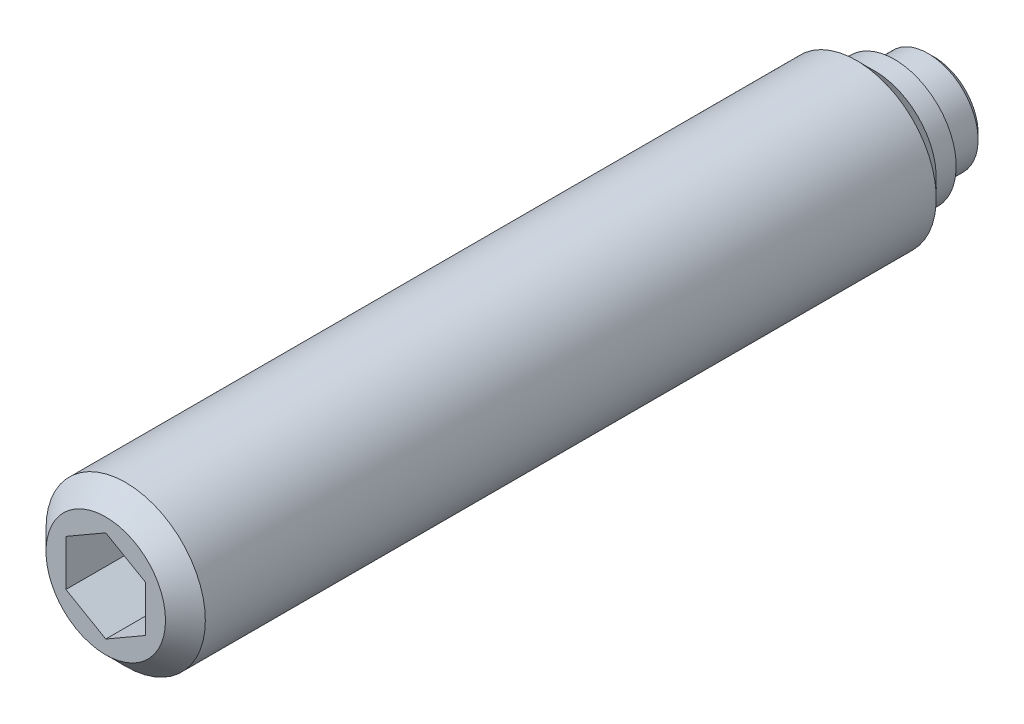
ISO-10303-21;
HEADER;
FILE_DESCRIPTION(('STEP AP214'),'2;1');
FILE_NAME('part.step','',(''),(''),'','','');
FILE_SCHEMA(('AUTOMOTIVE_DESIGN { 1 0 10303 214 1 1 1 1 }'));
ENDSEC;
DATA;
#1=APPLICATION_CONTEXT('core data for automotive mechanical design processes');
#2=APPLICATION_PROTOCOL_DEFINITION('international standard','automotive_design',2000,#1);
#3=PRODUCT_CONTEXT('',#1,'mechanical');
#4=PRODUCT('Part','Part','',(#3));
#5=PRODUCT_RELATED_PRODUCT_CATEGORY('part','',(#4));
#6=PRODUCT_DEFINITION_FORMATION('','',#4);
#7=PRODUCT_DEFINITION_CONTEXT('part definition',#1,'design');
#8=PRODUCT_DEFINITION('design','',#6,#7);
#9=PRODUCT_DEFINITION_SHAPE('','',#8);
#10=(LENGTH_UNIT() NAMED_UNIT(*) SI_UNIT(.MILLI.,.METRE.));
#11=(NAMED_UNIT(*) PLANE_ANGLE_UNIT() SI_UNIT($,.RADIAN.));
#12=(NAMED_UNIT(*) SI_UNIT($,.STERADIAN.) SOLID_ANGLE_UNIT());
#13=UNCERTAINTY_MEASURE_WITH_UNIT(LENGTH_MEASURE(1.E-05),#10,'distance_accuracy_value','');
#14=(GEOMETRIC_REPRESENTATION_CONTEXT(3) GLOBAL_UNCERTAINTY_ASSIGNED_CONTEXT((#13)) GLOBAL_UNIT_ASSIGNED_CONTEXT((#10,
#11,#12)) REPRESENTATION_CONTEXT('',''));
#15=CARTESIAN_POINT('',(0.,0.,0.));
#16=DIRECTION('',(0.,0.,1.));
#17=DIRECTION('',(1.,0.,0.));
#18=AXIS2_PLACEMENT_3D('',#15,#16,#17);
#19=CARTESIAN_POINT('',(0.,0.,2.));
#20=DIRECTION('',(0.,0.,-1.));
#21=DIRECTION('',(-1.,0.,0.));
#22=AXIS2_PLACEMENT_3D('',#19,#20,#21);
#23=CYLINDRICAL_SURFACE('',#22,4.);
#24=CARTESIAN_POINT('',(0.,0.,40.6));
#25=DIRECTION('',(0.,0.,1.));
#26=DIRECTION('',(1.,0.,0.));
#27=AXIS2_PLACEMENT_3D('',#24,#25,#26);
#28=CIRCLE('',#27,4.);
#29=CARTESIAN_POINT('',(4.,0.,40.6));
#30=VERTEX_POINT('',#29);
#31=EDGE_CURVE('E9',#30,#30,#28,.F.);
#32=ORIENTED_EDGE('',*,*,#31,.T.);
#33=EDGE_LOOP('',(#32));
#34=FACE_BOUND('',#33,.T.);
#35=CARTESIAN_POINT('',(0.,0.,3.9));
#36=DIRECTION('',(0.,0.,-1.));
#37=DIRECTION('',(-1.,0.,0.));
#38=AXIS2_PLACEMENT_3D('',#35,#36,#37);
#39=CIRCLE('',#38,4.);
#40=CARTESIAN_POINT('',(-4.,0.,3.9));
#41=VERTEX_POINT('',#40);
#42=EDGE_CURVE('E74',#41,#41,#39,.T.);
#43=ORIENTED_EDGE('',*,*,#42,.F.);
#44=EDGE_LOOP('',(#43));
#45=FACE_BOUND('',#44,.T.);
#46=ADVANCED_FACE('F14',(#34,#45),#23,.T.);
#47=CARTESIAN_POINT('',(0.,0.,0.));
#48=DIRECTION('',(0.,0.,-1.));
#49=DIRECTION('',(-1.,0.,0.));
#50=AXIS2_PLACEMENT_3D('',#47,#48,#49);
#51=CYLINDRICAL_SURFACE('',#50,2.5);
#52=CARTESIAN_POINT('',(0.,0.,0.3));
#53=DIRECTION('',(0.,0.,-1.));
#54=DIRECTION('',(-1.,0.,0.));
#55=AXIS2_PLACEMENT_3D('',#52,#53,#54);
#56=CIRCLE('',#55,2.5);
#57=CARTESIAN_POINT('',(-2.5,0.,0.3));
#58=VERTEX_POINT('',#57);
#59=EDGE_CURVE('E106',#58,#58,#56,.T.);
#60=ORIENTED_EDGE('',*,*,#59,.F.);
#61=EDGE_LOOP('',(#60));
#62=FACE_BOUND('',#61,.T.);
#63=CARTESIAN_POINT('',(0.,0.,2.));
#64=DIRECTION('',(0.,0.,-1.));
#65=DIRECTION('',(-1.,0.,0.));
#66=AXIS2_PLACEMENT_3D('',#63,#64,#65);
#67=CIRCLE('',#66,2.5);
#68=CARTESIAN_POINT('',(-2.5,0.,2.));
#69=VERTEX_POINT('',#68);
#70=EDGE_CURVE('E100',#69,#69,#67,.T.);
#71=ORIENTED_EDGE('',*,*,#70,.T.);
#72=EDGE_LOOP('',(#71));
#73=FACE_BOUND('',#72,.T.);
#74=ADVANCED_FACE('F130',(#62,#73),#51,.T.);
#75=CARTESIAN_POINT('',(0.,0.,0.3));
#76=DIRECTION('',(0.,0.,1.));
#77=DIRECTION('',(1.,0.,0.));
#78=AXIS2_PLACEMENT_3D('',#75,#76,#77);
#79=CONICAL_SURFACE('',#78,2.5,0.785398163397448);
#80=CARTESIAN_POINT('',(0.,0.,0.));
#81=DIRECTION('',(0.,0.,-1.));
#82=DIRECTION('',(-1.,0.,0.));
#83=AXIS2_PLACEMENT_3D('',#80,#81,#82);
#84=CIRCLE('',#83,2.2);
#85=CARTESIAN_POINT('',(-2.2,0.,0.));
#86=VERTEX_POINT('',#85);
#87=EDGE_CURVE('E103',#86,#86,#84,.T.);
#88=ORIENTED_EDGE('',*,*,#87,.F.);
#89=EDGE_LOOP('',(#88));
#90=FACE_BOUND('',#89,.T.);
#91=ORIENTED_EDGE('',*,*,#59,.T.);
#92=EDGE_LOOP('',(#91));
#93=FACE_BOUND('',#92,.T.);
#94=ADVANCED_FACE('F135',(#90,#93),#79,.T.);
#95=CARTESIAN_POINT('',(0.,2.2,0.));
#96=DIRECTION('',(0.,0.,1.));
#97=DIRECTION('',(1.,0.,0.));
#98=AXIS2_PLACEMENT_3D('',#95,#96,#97);
#99=PLANE('',#98);
#100=ORIENTED_EDGE('',*,*,#87,.T.);
#101=EDGE_LOOP('',(#100));
#102=FACE_BOUND('',#101,.T.);
#103=ADVANCED_FACE('F150',(#102),#99,.F.);
#104=CARTESIAN_POINT('',(0.,3.1,2.));
#105=DIRECTION('',(0.,0.,1.));
#106=DIRECTION('',(1.,0.,0.));
#107=AXIS2_PLACEMENT_3D('',#104,#105,#106);
#108=PLANE('',#107);
#109=CARTESIAN_POINT('',(0.,0.,2.));
#110=DIRECTION('',(0.,0.,-1.));
#111=DIRECTION('',(-1.,0.,0.));
#112=AXIS2_PLACEMENT_3D('',#109,#110,#111);
#113=CIRCLE('',#112,3.1);
#114=CARTESIAN_POINT('',(-3.1,0.,2.));
#115=VERTEX_POINT('',#114);
#116=EDGE_CURVE('E109',#115,#115,#113,.T.);
#117=ORIENTED_EDGE('',*,*,#116,.T.);
#118=EDGE_LOOP('',(#117));
#119=FACE_BOUND('',#118,.T.);
#120=ORIENTED_EDGE('',*,*,#70,.F.);
#121=EDGE_LOOP('',(#120));
#122=FACE_BOUND('',#121,.T.);
#123=ADVANCED_FACE('F147',(#119,#122),#108,.F.);
#124=CARTESIAN_POINT('',(0.,0.,2.));
#125=DIRECTION('',(0.,0.,-1.));
#126=DIRECTION('',(-1.,0.,0.));
#127=AXIS2_PLACEMENT_3D('',#124,#125,#126);
#128=CYLINDRICAL_SURFACE('',#127,3.1);
#129=CARTESIAN_POINT('',(0.,0.,3.));
#130=DIRECTION('',(0.,0.,-1.));
#131=DIRECTION('',(-1.,0.,0.));
#132=AXIS2_PLACEMENT_3D('',#129,#130,#131);
#133=CIRCLE('',#132,3.1);
#134=CARTESIAN_POINT('',(-3.1,0.,3.));
#135=VERTEX_POINT('',#134);
#136=EDGE_CURVE('E112',#135,#135,#133,.T.);
#137=ORIENTED_EDGE('',*,*,#136,.T.);
#138=EDGE_LOOP('',(#137));
#139=FACE_BOUND('',#138,.T.);
#140=ORIENTED_EDGE('',*,*,#116,.F.);
#141=EDGE_LOOP('',(#140));
#142=FACE_BOUND('',#141,.T.);
#143=ADVANCED_FACE('F143',(#139,#142),#128,.T.);
#144=CARTESIAN_POINT('',(0.,0.,3.9));
#145=DIRECTION('',(0.,0.,1.));
#146=DIRECTION('',(1.,0.,0.));
#147=AXIS2_PLACEMENT_3D('',#144,#145,#146);
#148=CONICAL_SURFACE('',#147,4.,0.78539816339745);
#149=ORIENTED_EDGE('',*,*,#42,.T.);
#150=EDGE_LOOP('',(#149));
#151=FACE_BOUND('',#150,.T.);
#152=ORIENTED_EDGE('',*,*,#136,.F.);
#153=EDGE_LOOP('',(#152));
#154=FACE_BOUND('',#153,.T.);
#155=ADVANCED_FACE('F140',(#151,#154),#148,.T.);
#156=CARTESIAN_POINT('',(0.,0.,41.6));
#157=DIRECTION('',(0.,0.,1.));
#158=DIRECTION('',(1.,0.,0.));
#159=AXIS2_PLACEMENT_3D('',#156,#157,#158);
#160=PLANE('',#159);
#161=CARTESIAN_POINT('',(0.,0.,41.6));
#162=DIRECTION('',(0.,0.,1.));
#163=DIRECTION('',(1.,0.,0.));
#164=AXIS2_PLACEMENT_3D('',#161,#162,#163);
#165=CIRCLE('',#164,3.);
#166=CARTESIAN_POINT('',(3.,0.,41.6));
#167=VERTEX_POINT('',#166);
#168=EDGE_CURVE('E22',#167,#167,#165,.T.);
#169=ORIENTED_EDGE('',*,*,#168,.T.);
#170=EDGE_LOOP('',(#169));
#171=FACE_BOUND('',#170,.T.);
#172=DIRECTION('',(-0.866025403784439,0.5,0.));
#173=VECTOR('',#172,1.);
#174=CARTESIAN_POINT('',(-2.,-1.15470053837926,41.6));
#175=LINE('',#174,#173);
#176=CARTESIAN_POINT('',(0.,-2.30940107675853,41.6));
#177=VERTEX_POINT('',#176);
#178=CARTESIAN_POINT('',(-2.,-1.15470053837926,41.6));
#179=VERTEX_POINT('',#178);
#180=EDGE_CURVE('E69',#177,#179,#175,.T.);
#181=ORIENTED_EDGE('',*,*,#180,.T.);
#182=DIRECTION('',(0.,1.,0.));
#183=VECTOR('',#182,1.);
#184=CARTESIAN_POINT('',(-2.,1.15470053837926,41.6));
#185=LINE('',#184,#183);
#186=CARTESIAN_POINT('',(-2.,1.15470053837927,41.6));
#187=VERTEX_POINT('',#186);
#188=EDGE_CURVE('E84',#179,#187,#185,.T.);
#189=ORIENTED_EDGE('',*,*,#188,.T.);
#190=DIRECTION('',(0.866025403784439,0.5,0.));
#191=VECTOR('',#190,1.);
#192=CARTESIAN_POINT('',(0.,2.30940107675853,41.6));
#193=LINE('',#192,#191);
#194=CARTESIAN_POINT('',(0.,2.30940107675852,41.6));
#195=VERTEX_POINT('',#194);
#196=EDGE_CURVE('E301',#187,#195,#193,.T.);
#197=ORIENTED_EDGE('',*,*,#196,.T.);
#198=DIRECTION('',(0.866025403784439,-0.5,0.));
#199=VECTOR('',#198,1.);
#200=CARTESIAN_POINT('',(2.,1.15470053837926,41.6));
#201=LINE('',#200,#199);
#202=CARTESIAN_POINT('',(2.,1.15470053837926,41.6));
#203=VERTEX_POINT('',#202);
#204=EDGE_CURVE('E298',#195,#203,#201,.T.);
#205=ORIENTED_EDGE('',*,*,#204,.T.);
#206=DIRECTION('',(0.,-1.,0.));
#207=VECTOR('',#206,1.);
#208=CARTESIAN_POINT('',(2.,-1.15470053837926,41.6));
#209=LINE('',#208,#207);
#210=CARTESIAN_POINT('',(2.,-1.15470053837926,41.6));
#211=VERTEX_POINT('',#210);
#212=EDGE_CURVE('E29',#203,#211,#209,.T.);
#213=ORIENTED_EDGE('',*,*,#212,.T.);
#214=DIRECTION('',(-0.866025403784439,-0.5,0.));
#215=VECTOR('',#214,1.);
#216=CARTESIAN_POINT('',(0.,-2.30940107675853,41.6));
#217=LINE('',#216,#215);
#218=EDGE_CURVE('E66',#211,#177,#217,.T.);
#219=ORIENTED_EDGE('',*,*,#218,.T.);
#220=EDGE_LOOP('',(#181,#189,#197,#205,#213,#219));
#221=FACE_BOUND('',#220,.T.);
#222=ADVANCED_FACE('F68',(#171,#221),#160,.T.);
#223=CARTESIAN_POINT('',(0.,0.,36.6));
#224=DIRECTION('',(0.,0.,1.));
#225=DIRECTION('',(1.,0.,0.));
#226=AXIS2_PLACEMENT_3D('',#223,#224,#225);
#227=PLANE('',#226);
#228=DIRECTION('',(0.,-1.,0.));
#229=VECTOR('',#228,1.);
#230=CARTESIAN_POINT('',(-2.,1.15470053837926,36.6));
#231=LINE('',#230,#229);
#232=CARTESIAN_POINT('',(-2.,1.15470053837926,36.6));
#233=VERTEX_POINT('',#232);
#234=CARTESIAN_POINT('',(-2.,-1.15470053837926,36.6));
#235=VERTEX_POINT('',#234);
#236=EDGE_CURVE('E83',#233,#235,#231,.T.);
#237=ORIENTED_EDGE('',*,*,#236,.T.);
#238=DIRECTION('',(0.866025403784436,-0.5,0.));
#239=VECTOR('',#238,1.);
#240=CARTESIAN_POINT('',(-2.,-1.15470053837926,36.6));
#241=LINE('',#240,#239);
#242=CARTESIAN_POINT('',(0.,-2.30940107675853,36.6));
#243=VERTEX_POINT('',#242);
#244=EDGE_CURVE('E280',#235,#243,#241,.T.);
#245=ORIENTED_EDGE('',*,*,#244,.T.);
#246=DIRECTION('',(0.866025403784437,0.5,0.));
#247=VECTOR('',#246,1.);
#248=CARTESIAN_POINT('',(0.,-2.30940107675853,36.6));
#249=LINE('',#248,#247);
#250=CARTESIAN_POINT('',(2.,-1.15470053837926,36.6));
#251=VERTEX_POINT('',#250);
#252=EDGE_CURVE('E88',#243,#251,#249,.T.);
#253=ORIENTED_EDGE('',*,*,#252,.T.);
#254=DIRECTION('',(0.,1.,0.));
#255=VECTOR('',#254,1.);
#256=CARTESIAN_POINT('',(2.,-1.15470053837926,36.6));
#257=LINE('',#256,#255);
#258=CARTESIAN_POINT('',(2.,1.15470053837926,36.6));
#259=VERTEX_POINT('',#258);
#260=EDGE_CURVE('E287',#251,#259,#257,.T.);
#261=ORIENTED_EDGE('',*,*,#260,.T.);
#262=DIRECTION('',(-0.866025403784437,0.5,0.));
#263=VECTOR('',#262,1.);
#264=CARTESIAN_POINT('',(2.,1.15470053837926,36.6));
#265=LINE('',#264,#263);
#266=CARTESIAN_POINT('',(0.,2.30940107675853,36.6));
#267=VERTEX_POINT('',#266);
#268=EDGE_CURVE('E96',#259,#267,#265,.T.);
#269=ORIENTED_EDGE('',*,*,#268,.T.);
#270=DIRECTION('',(-0.866025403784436,-0.5,0.));
#271=VECTOR('',#270,1.);
#272=CARTESIAN_POINT('',(0.,2.30940107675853,36.6));
#273=LINE('',#272,#271);
#274=EDGE_CURVE('E91',#267,#233,#273,.T.);
#275=ORIENTED_EDGE('',*,*,#274,.T.);
#276=EDGE_LOOP('',(#237,#245,#253,#261,#269,#275));
#277=FACE_BOUND('',#276,.T.);
#278=ADVANCED_FACE('F162',(#277),#227,.T.);
#279=CARTESIAN_POINT('',(0.,-2.30940107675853,46.6));
#280=DIRECTION('',(0.5,-0.866025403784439,0.));
#281=DIRECTION('',(0.866025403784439,0.5,0.));
#282=AXIS2_PLACEMENT_3D('',#279,#280,#281);
#283=PLANE('',#282);
#284=ORIENTED_EDGE('',*,*,#218,.F.);
#285=DIRECTION('',(0.,0.,1.));
#286=VECTOR('',#285,1.);
#287=CARTESIAN_POINT('',(2.,-1.15470053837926,46.6));
#288=LINE('',#287,#286);
#289=EDGE_CURVE('E90',#251,#211,#288,.T.);
#290=ORIENTED_EDGE('',*,*,#289,.F.);
#291=ORIENTED_EDGE('',*,*,#252,.F.);
#292=DIRECTION('',(0.,0.,1.));
#293=VECTOR('',#292,1.);
#294=CARTESIAN_POINT('',(0.,-2.30940107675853,46.6));
#295=LINE('',#294,#293);
#296=EDGE_CURVE('E80',#243,#177,#295,.T.);
#297=ORIENTED_EDGE('',*,*,#296,.T.);
#298=EDGE_LOOP('',(#284,#290,#291,#297));
#299=FACE_BOUND('',#298,.T.);
#300=ADVANCED_FACE('F86',(#299),#283,.F.);
#301=CARTESIAN_POINT('',(2.,-1.15470053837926,46.6));
#302=DIRECTION('',(1.,0.,0.));
#303=DIRECTION('',(0.,0.,-1.));
#304=AXIS2_PLACEMENT_3D('',#301,#302,#303);
#305=PLANE('',#304);
#306=ORIENTED_EDGE('',*,*,#212,.F.);
#307=DIRECTION('',(0.,0.,1.));
#308=VECTOR('',#307,1.);
#309=CARTESIAN_POINT('',(2.,1.15470053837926,46.6));
#310=LINE('',#309,#308);
#311=EDGE_CURVE('E93',#259,#203,#310,.T.);
#312=ORIENTED_EDGE('',*,*,#311,.F.);
#313=ORIENTED_EDGE('',*,*,#260,.F.);
#314=ORIENTED_EDGE('',*,*,#289,.T.);
#315=EDGE_LOOP('',(#306,#312,#313,#314));
#316=FACE_BOUND('',#315,.T.);
#317=ADVANCED_FACE('F161',(#316),#305,.F.);
#318=CARTESIAN_POINT('',(2.,1.15470053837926,46.6));
#319=DIRECTION('',(0.5,0.866025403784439,0.));
#320=DIRECTION('',(-0.866025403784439,0.5,0.));
#321=AXIS2_PLACEMENT_3D('',#318,#319,#320);
#322=PLANE('',#321);
#323=ORIENTED_EDGE('',*,*,#204,.F.);
#324=DIRECTION('',(0.,0.,1.));
#325=VECTOR('',#324,1.);
#326=CARTESIAN_POINT('',(0.,2.30940107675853,46.6));
#327=LINE('',#326,#325);
#328=EDGE_CURVE('E293',#267,#195,#327,.T.);
#329=ORIENTED_EDGE('',*,*,#328,.F.);
#330=ORIENTED_EDGE('',*,*,#268,.F.);
#331=ORIENTED_EDGE('',*,*,#311,.T.);
#332=EDGE_LOOP('',(#323,#329,#330,#331));
#333=FACE_BOUND('',#332,.T.);
#334=ADVANCED_FACE('F165',(#333),#322,.F.);
#335=CARTESIAN_POINT('',(0.,2.30940107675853,46.6));
#336=DIRECTION('',(-0.5,0.866025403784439,0.));
#337=DIRECTION('',(-0.866025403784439,-0.5,0.));
#338=AXIS2_PLACEMENT_3D('',#335,#336,#337);
#339=PLANE('',#338);
#340=ORIENTED_EDGE('',*,*,#196,.F.);
#341=DIRECTION('',(0.,0.,1.));
#342=VECTOR('',#341,1.);
#343=CARTESIAN_POINT('',(-2.,1.15470053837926,46.6));
#344=LINE('',#343,#342);
#345=EDGE_CURVE('E37',#233,#187,#344,.T.);
#346=ORIENTED_EDGE('',*,*,#345,.F.);
#347=ORIENTED_EDGE('',*,*,#274,.F.);
#348=ORIENTED_EDGE('',*,*,#328,.T.);
#349=EDGE_LOOP('',(#340,#346,#347,#348));
#350=FACE_BOUND('',#349,.T.);
#351=ADVANCED_FACE('F169',(#350),#339,.F.);
#352=CARTESIAN_POINT('',(-2.,1.15470053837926,46.6));
#353=DIRECTION('',(-1.,0.,0.));
#354=DIRECTION('',(0.,0.,1.));
#355=AXIS2_PLACEMENT_3D('',#352,#353,#354);
#356=PLANE('',#355);
#357=ORIENTED_EDGE('',*,*,#188,.F.);
#358=DIRECTION('',(0.,0.,1.));
#359=VECTOR('',#358,1.);
#360=CARTESIAN_POINT('',(-2.,-1.15470053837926,46.6));
#361=LINE('',#360,#359);
#362=EDGE_CURVE('E82',#235,#179,#361,.T.);
#363=ORIENTED_EDGE('',*,*,#362,.F.);
#364=ORIENTED_EDGE('',*,*,#236,.F.);
#365=ORIENTED_EDGE('',*,*,#345,.T.);
#366=EDGE_LOOP('',(#357,#363,#364,#365));
#367=FACE_BOUND('',#366,.T.);
#368=ADVANCED_FACE('F126',(#367),#356,.F.);
#369=CARTESIAN_POINT('',(-2.,-1.15470053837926,46.6));
#370=DIRECTION('',(-0.5,-0.866025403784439,0.));
#371=DIRECTION('',(0.866025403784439,-0.5,0.));
#372=AXIS2_PLACEMENT_3D('',#369,#370,#371);
#373=PLANE('',#372);
#374=ORIENTED_EDGE('',*,*,#180,.F.);
#375=ORIENTED_EDGE('',*,*,#296,.F.);
#376=ORIENTED_EDGE('',*,*,#244,.F.);
#377=ORIENTED_EDGE('',*,*,#362,.T.);
#378=EDGE_LOOP('',(#374,#375,#376,#377));
#379=FACE_BOUND('',#378,.T.);
#380=ADVANCED_FACE('F78',(#379),#373,.F.);
#381=CARTESIAN_POINT('',(0.,0.,41.6));
#382=DIRECTION('',(0.,0.,-1.));
#383=DIRECTION('',(-1.,0.,0.));
#384=AXIS2_PLACEMENT_3D('',#381,#382,#383);
#385=CONICAL_SURFACE('',#384,3.,0.785398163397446);
#386=ORIENTED_EDGE('',*,*,#31,.F.);
#387=EDGE_LOOP('',(#386));
#388=FACE_BOUND('',#387,.T.);
#389=ORIENTED_EDGE('',*,*,#168,.F.);
#390=EDGE_LOOP('',(#389));
#391=FACE_BOUND('',#390,.T.);
#392=ADVANCED_FACE('F16',(#388,#391),#385,.T.);
#393=CLOSED_SHELL('',(#46,#74,#94,#103,#123,#143,#155,#222,#278,#300,#317,#334,#351,#368,#380,#392));
#394=MANIFOLD_SOLID_BREP('B1',#393);
#395=ADVANCED_BREP_SHAPE_REPRESENTATION('',(#18,#394),#14);
#396=SHAPE_DEFINITION_REPRESENTATION(#9,#395);
ENDSEC;
END-ISO-10303-21;
